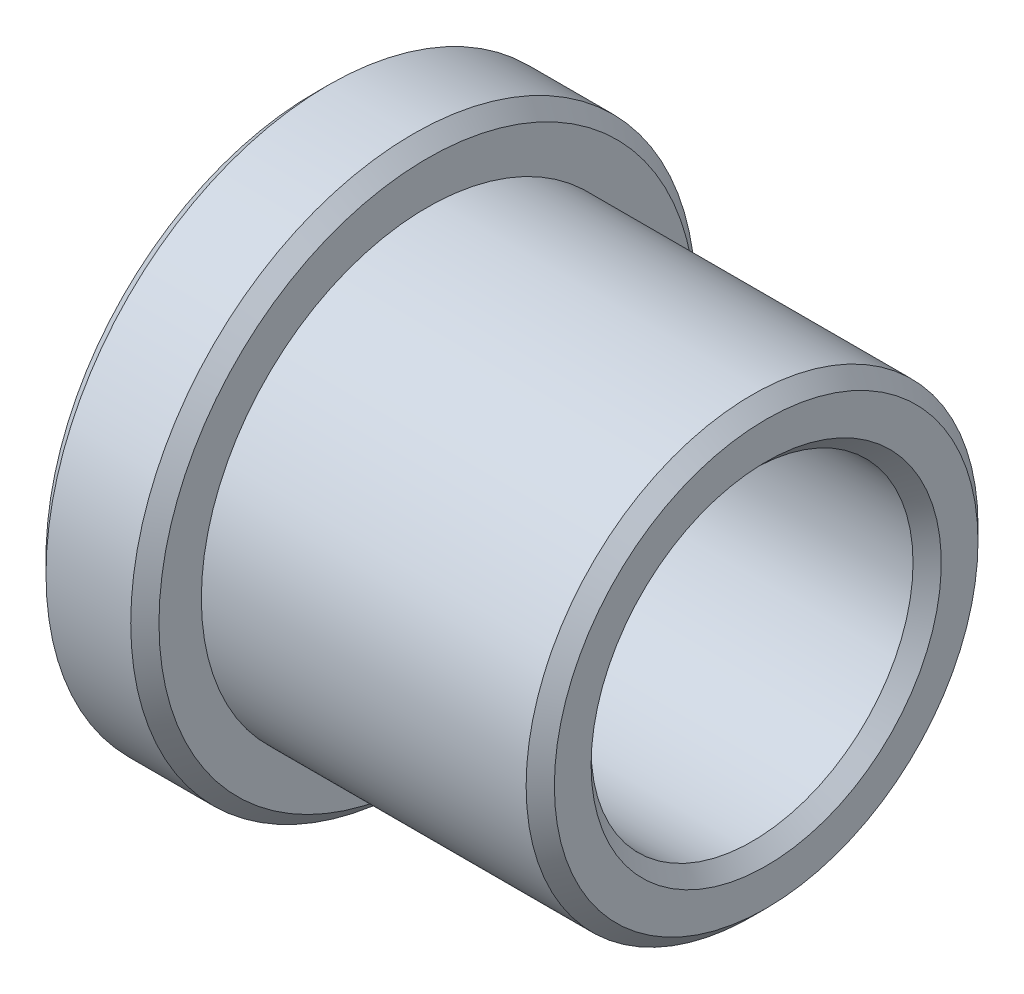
from build123d import *

# Parameters (mm, degrees)
CHANFREIN1_SIZE = 0.25


with BuildPart() as part:
    # Esquisse1 → R_volution1 (revolve)
    with BuildSketch(Plane.XY, mode=Mode.PRIVATE) as r_volution1_sk:
        Polygon((0, 2.85), (8, 2.85), (8, 4), (2, 4), (2, 5), (0, 5), align=None)
    revolve(r_volution1_sk.sketch.rotate(Axis((0, 0, 0), (1, 0, 0)), 90), axis=Axis((0, 0, 0), (1, 0, 0)))

    # Chanfrein1
    chanfrein1_edges = [part.edges().sort_by_distance(p)[0] for p in [
        (0, 0, -5),
        (2, 0, -5),
        (8, 0, -4),
        (8, 0, -2.85),
        (0, 0, -2.85),
    ]]
    chamfer(chanfrein1_edges, length=CHANFREIN1_SIZE)


solid = part.part
